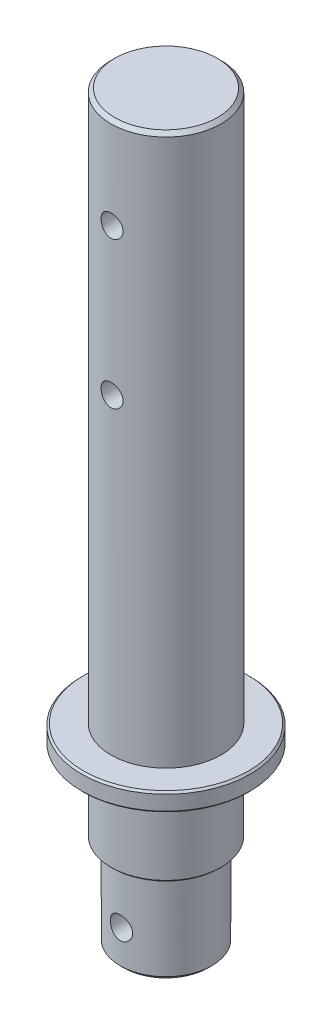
ISO-10303-21;
HEADER;
FILE_DESCRIPTION(('STEP AP214'),'2;1');
FILE_NAME('part.step','',(''),(''),'','','');
FILE_SCHEMA(('AUTOMOTIVE_DESIGN { 1 0 10303 214 1 1 1 1 }'));
ENDSEC;
DATA;
#1=APPLICATION_CONTEXT('core data for automotive mechanical design processes');
#2=APPLICATION_PROTOCOL_DEFINITION('international standard','automotive_design',2000,#1);
#3=PRODUCT_CONTEXT('',#1,'mechanical');
#4=PRODUCT('Part','Part','',(#3));
#5=PRODUCT_RELATED_PRODUCT_CATEGORY('part','',(#4));
#6=PRODUCT_DEFINITION_FORMATION('','',#4);
#7=PRODUCT_DEFINITION_CONTEXT('part definition',#1,'design');
#8=PRODUCT_DEFINITION('design','',#6,#7);
#9=PRODUCT_DEFINITION_SHAPE('','',#8);
#10=(LENGTH_UNIT() NAMED_UNIT(*) SI_UNIT(.MILLI.,.METRE.));
#11=(NAMED_UNIT(*) PLANE_ANGLE_UNIT() SI_UNIT($,.RADIAN.));
#12=(NAMED_UNIT(*) SI_UNIT($,.STERADIAN.) SOLID_ANGLE_UNIT());
#13=UNCERTAINTY_MEASURE_WITH_UNIT(LENGTH_MEASURE(1.E-05),#10,'distance_accuracy_value','');
#14=(GEOMETRIC_REPRESENTATION_CONTEXT(3) GLOBAL_UNCERTAINTY_ASSIGNED_CONTEXT((#13)) GLOBAL_UNIT_ASSIGNED_CONTEXT((#10,
#11,#12)) REPRESENTATION_CONTEXT('',''));
#15=CARTESIAN_POINT('',(0.,0.,0.));
#16=DIRECTION('',(0.,0.,1.));
#17=DIRECTION('',(1.,0.,0.));
#18=AXIS2_PLACEMENT_3D('',#15,#16,#17);
#19=CARTESIAN_POINT('',(-15.,202.,0.));
#20=DIRECTION('',(0.,1.,0.));
#21=DIRECTION('',(0.,0.,1.));
#22=AXIS2_PLACEMENT_3D('',#19,#20,#21);
#23=PLANE('',#22);
#24=CARTESIAN_POINT('',(0.,202.,0.));
#25=DIRECTION('',(0.,1.,0.));
#26=DIRECTION('',(0.,0.,1.));
#27=AXIS2_PLACEMENT_3D('',#24,#25,#26);
#28=CIRCLE('',#27,14.);
#29=CARTESIAN_POINT('',(0.,202.,14.));
#30=VERTEX_POINT('',#29);
#31=EDGE_CURVE('E149',#30,#30,#28,.T.);
#32=ORIENTED_EDGE('',*,*,#31,.T.);
#33=EDGE_LOOP('',(#32));
#34=FACE_BOUND('',#33,.T.);
#35=ADVANCED_FACE('F33',(#34),#23,.T.);
#36=CARTESIAN_POINT('',(0.,215.720868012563,0.));
#37=DIRECTION('',(0.,1.,0.));
#38=DIRECTION('',(0.,0.,1.));
#39=AXIS2_PLACEMENT_3D('',#36,#37,#38);
#40=CYLINDRICAL_SURFACE('',#39,15.);
#41=CARTESIAN_POINT('',(0.,134.,15.));
#42=CARTESIAN_POINT('',(0.1667307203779,134.000006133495,14.9999969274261));
#43=CARTESIAN_POINT('',(0.333538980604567,134.013946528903,14.9971915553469));
#44=CARTESIAN_POINT('',(0.662440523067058,134.069295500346,14.9862709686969));
#45=CARTESIAN_POINT('',(0.824529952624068,134.110725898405,14.9781515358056));
#46=CARTESIAN_POINT('',(1.13919091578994,134.219723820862,14.9575094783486));
#47=CARTESIAN_POINT('',(1.2917714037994,134.287266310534,14.9449910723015));
#48=CARTESIAN_POINT('',(1.58342396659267,134.446496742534,14.9169119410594));
#49=CARTESIAN_POINT('',(1.72249684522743,134.538183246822,14.9013513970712));
#50=CARTESIAN_POINT('',(1.9850804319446,134.744415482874,14.8686649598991));
#51=CARTESIAN_POINT('',(2.10838185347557,134.859225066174,14.8515223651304));
#52=CARTESIAN_POINT('',(2.33411026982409,135.107877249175,14.8177254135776));
#53=CARTESIAN_POINT('',(2.43653563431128,135.241721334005,14.8010710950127));
#54=CARTESIAN_POINT('',(2.61849526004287,135.526148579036,14.7699732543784));
#55=CARTESIAN_POINT('',(2.6978128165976,135.676872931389,14.7555512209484));
#56=CARTESIAN_POINT('',(2.82991699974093,135.989845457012,14.7307880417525));
#57=CARTESIAN_POINT('',(2.88270624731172,136.152092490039,14.7204464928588));
#58=CARTESIAN_POINT('',(2.95957589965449,136.481253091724,14.7051841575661));
#59=CARTESIAN_POINT('',(2.98402349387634,136.648077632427,14.7001941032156));
#60=CARTESIAN_POINT('',(3.00465638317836,136.983529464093,14.6959912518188));
#61=CARTESIAN_POINT('',(3.0008445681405,137.15215656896,14.6967778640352));
#62=CARTESIAN_POINT('',(2.96536371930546,137.483740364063,14.7039765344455));
#63=CARTESIAN_POINT('',(2.93411562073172,137.646744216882,14.7103035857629));
#64=CARTESIAN_POINT('',(2.84531365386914,137.965148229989,14.7277363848));
#65=CARTESIAN_POINT('',(2.78775852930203,138.120548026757,14.7388423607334));
#66=CARTESIAN_POINT('',(2.64757435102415,138.420545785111,14.7646685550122));
#67=CARTESIAN_POINT('',(2.56477845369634,138.565063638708,14.7794126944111));
#68=CARTESIAN_POINT('',(2.37658072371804,138.838312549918,14.8108385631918));
#69=CARTESIAN_POINT('',(2.27117629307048,138.967041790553,14.827520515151));
#70=CARTESIAN_POINT('',(2.03849980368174,139.207488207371,14.8613106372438));
#71=CARTESIAN_POINT('',(1.91086848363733,139.318857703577,14.8784210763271));
#72=CARTESIAN_POINT('',(1.63855507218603,139.518661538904,14.9108654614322));
#73=CARTESIAN_POINT('',(1.49387276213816,139.607095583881,14.9261993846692));
#74=CARTESIAN_POINT('',(1.19117816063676,139.758582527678,14.9534007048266));
#75=CARTESIAN_POINT('',(1.03314545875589,139.821595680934,14.9652626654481));
#76=CARTESIAN_POINT('',(0.708446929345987,139.920081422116,14.9841422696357));
#77=CARTESIAN_POINT('',(0.541782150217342,139.955557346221,14.9911605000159));
#78=CARTESIAN_POINT('',(0.207538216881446,139.997469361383,14.999480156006));
#79=CARTESIAN_POINT('',(0.0400209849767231,140.004381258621,15.0008752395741));
#80=CARTESIAN_POINT('',(-0.293774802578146,139.990250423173,14.9980515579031));
#81=CARTESIAN_POINT('',(-0.460053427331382,139.969209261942,14.9938331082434));
#82=CARTESIAN_POINT('',(-0.785116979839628,139.900164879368,14.9803149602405));
#83=CARTESIAN_POINT('',(-0.943955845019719,139.852405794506,14.9710612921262));
#84=CARTESIAN_POINT('',(-1.25137088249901,139.731548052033,14.948506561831));
#85=CARTESIAN_POINT('',(-1.39994628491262,139.65844749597,14.9352051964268));
#86=CARTESIAN_POINT('',(-1.68462352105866,139.487952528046,14.9057973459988));
#87=CARTESIAN_POINT('',(-1.82055038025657,139.390271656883,14.8896585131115));
#88=CARTESIAN_POINT('',(-2.07425405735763,139.173772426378,14.8564420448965));
#89=CARTESIAN_POINT('',(-2.19202892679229,139.0549518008,14.8393643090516));
#90=CARTESIAN_POINT('',(-2.40792177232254,138.797379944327,14.8058791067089));
#91=CARTESIAN_POINT('',(-2.50571310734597,138.658352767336,14.7894858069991));
#92=CARTESIAN_POINT('',(-2.67655626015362,138.36556591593,14.7595257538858));
#93=CARTESIAN_POINT('',(-2.74960906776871,138.211806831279,14.7459588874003));
#94=CARTESIAN_POINT('',(-2.86845552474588,137.894695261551,14.7233022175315));
#95=CARTESIAN_POINT('',(-2.91439049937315,137.731397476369,14.7141892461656));
#96=CARTESIAN_POINT('',(-2.97812595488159,137.399199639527,14.7014231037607));
#97=CARTESIAN_POINT('',(-2.99593010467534,137.230300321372,14.6977692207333));
#98=CARTESIAN_POINT('',(-3.00276273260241,136.894973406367,14.6963744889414));
#99=CARTESIAN_POINT('',(-2.99230736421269,136.728556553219,14.698527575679));
#100=CARTESIAN_POINT('',(-2.94405691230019,136.399905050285,14.7082672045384));
#101=CARTESIAN_POINT('',(-2.9062620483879,136.237670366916,14.7158537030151));
#102=CARTESIAN_POINT('',(-2.80463570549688,135.922316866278,14.7355579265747));
#103=CARTESIAN_POINT('',(-2.74086752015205,135.769176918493,14.7476646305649));
#104=CARTESIAN_POINT('',(-2.58916393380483,135.475688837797,14.7750514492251));
#105=CARTESIAN_POINT('',(-2.50122650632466,135.335341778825,14.7903318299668));
#106=CARTESIAN_POINT('',(-2.30191774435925,135.068853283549,14.8226688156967));
#107=CARTESIAN_POINT('',(-2.19017366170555,134.942993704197,14.839751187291));
#108=CARTESIAN_POINT('',(-1.94719310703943,134.711641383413,14.8735824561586));
#109=CARTESIAN_POINT('',(-1.81595216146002,134.606153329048,14.8903312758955));
#110=CARTESIAN_POINT('',(-1.53605288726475,134.417496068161,14.9218149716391));
#111=CARTESIAN_POINT('',(-1.38722665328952,134.33457199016,14.9365269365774));
#112=CARTESIAN_POINT('',(-1.0774990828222,134.19504163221,14.96205375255));
#113=CARTESIAN_POINT('',(-0.916608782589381,134.138411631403,14.9728721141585));
#114=CARTESIAN_POINT('',(-0.629464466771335,134.064044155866,14.9872911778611));
#115=CARTESIAN_POINT('',(-0.50484499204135,134.040070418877,14.9920290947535));
#116=CARTESIAN_POINT('',(-0.253498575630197,134.008046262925,14.9983846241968));
#117=CARTESIAN_POINT('',(-0.126771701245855,133.999995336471,15.0000023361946));
#118=CARTESIAN_POINT('',(0.,134.,15.));
#119=B_SPLINE_CURVE_WITH_KNOTS('',3,(#41,#42,#43,#44,#45,#46,#47,#48,#49,#50,#51,#52,#53,#54,
#55,#56,#57,#58,#59,#60,#61,#62,#63,#64,#65,#66,#67,#68,#69,#70,#71,#72,#73,#74,#75,#76,#77,#78,
#79,#80,#81,#82,#83,#84,#85,#86,#87,#88,#89,#90,#91,#92,#93,#94,#95,#96,#97,#98,#99,#100,#101,
#102,#103,#104,#105,#106,#107,#108,#109,#110,#111,#112,#113,#114,#115,#116,#117,#118),
.UNSPECIFIED.,.T.,.F.,(4,2,2,2,2,2,2,2,2,2,2,2,2,2,2,2,2,2,2,2,2,2,2,2,2,2,2,2,2,2,2,2,2,2,2,2,
2,2,4),(0.,0.499728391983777,0.999853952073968,1.49950120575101,1.99911870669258,
2.50479801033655,3.01051679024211,3.52083585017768,4.03110448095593,4.53468555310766,
5.03821512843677,5.53415181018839,6.03011217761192,6.52942470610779,7.02879464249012,
7.53714757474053,8.04550702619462,8.55465824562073,9.06374777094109,9.56432207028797,
10.064868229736,10.5609136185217,11.0569961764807,11.5591519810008,12.0613616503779,
12.5712188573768,13.081055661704,13.5882114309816,14.0953010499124,14.593191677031,
15.0910783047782,15.5877588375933,16.084481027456,16.5896422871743,17.0949196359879,
17.6054849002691,18.1155886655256,18.4955632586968,18.8755257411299),.UNSPECIFIED.);
#120=CARTESIAN_POINT('',(0.,134.,15.));
#121=VERTEX_POINT('',#120);
#122=EDGE_CURVE('E96',#121,#121,#119,.T.);
#123=ORIENTED_EDGE('',*,*,#122,.F.);
#124=EDGE_LOOP('',(#123));
#125=FACE_BOUND('',#124,.T.);
#126=CARTESIAN_POINT('',(3.,137.,-14.6969384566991));
#127=CARTESIAN_POINT('',(2.99999383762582,136.833306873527,-14.6969417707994));
#128=CARTESIAN_POINT('',(2.98605951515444,136.66653613,-14.699805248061));
#129=CARTESIAN_POINT('',(2.93073685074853,136.337712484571,-14.7109329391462));
#130=CARTESIAN_POINT('',(2.88932654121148,136.175663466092,-14.7192014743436));
#131=CARTESIAN_POINT('',(2.78038734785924,135.861088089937,-14.7401662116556));
#132=CARTESIAN_POINT('',(2.71288444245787,135.708552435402,-14.7528580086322));
#133=CARTESIAN_POINT('',(2.55374732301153,135.416975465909,-14.7812339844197));
#134=CARTESIAN_POINT('',(2.46211445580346,135.277933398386,-14.7969179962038));
#135=CARTESIAN_POINT('',(2.25593722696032,135.015316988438,-14.8297589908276));
#136=CARTESIAN_POINT('',(2.14111696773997,134.891961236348,-14.8469321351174));
#137=CARTESIAN_POINT('',(1.89242036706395,134.666127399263,-14.8806741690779));
#138=CARTESIAN_POINT('',(1.75854269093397,134.563650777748,-14.8972430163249));
#139=CARTESIAN_POINT('',(1.47408406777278,134.381635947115,-14.9280838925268));
#140=CARTESIAN_POINT('',(1.32336770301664,134.30230545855,-14.9423346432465));
#141=CARTESIAN_POINT('',(1.01041245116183,134.170175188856,-14.9667521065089));
#142=CARTESIAN_POINT('',(0.848174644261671,134.117372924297,-14.9769192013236));
#143=CARTESIAN_POINT('',(0.519050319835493,134.040478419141,-14.9919096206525));
#144=CARTESIAN_POINT('',(0.352253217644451,134.016017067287,-14.9968015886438));
#145=CARTESIAN_POINT('',(0.0168557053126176,133.995347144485,-15.0009276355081));
#146=CARTESIAN_POINT('',(-0.15174452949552,133.999135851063,-15.0001622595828));
#147=CARTESIAN_POINT('',(-0.483426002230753,134.034578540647,-14.9931130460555));
#148=CARTESIAN_POINT('',(-0.646551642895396,134.065834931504,-14.9869079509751));
#149=CARTESIAN_POINT('',(-0.965194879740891,134.154695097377,-14.9697653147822));
#150=CARTESIAN_POINT('',(-1.12071217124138,134.212299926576,-14.9588275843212));
#151=CARTESIAN_POINT('',(-1.42085838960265,134.352590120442,-14.9333188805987));
#152=CARTESIAN_POINT('',(-1.56541252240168,134.435431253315,-14.9187254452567));
#153=CARTESIAN_POINT('',(-1.83871513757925,134.62372723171,-14.8875140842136));
#154=CARTESIAN_POINT('',(-1.967461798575,134.729184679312,-14.8708959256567));
#155=CARTESIAN_POINT('',(-2.20785429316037,134.961900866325,-14.8371289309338));
#156=CARTESIAN_POINT('',(-2.31916294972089,135.089507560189,-14.8199758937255));
#157=CARTESIAN_POINT('',(-2.51885547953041,135.361749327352,-14.7873471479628));
#158=CARTESIAN_POINT('',(-2.60723891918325,135.50638472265,-14.7718714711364));
#159=CARTESIAN_POINT('',(-2.75868844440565,135.809062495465,-14.7443414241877));
#160=CARTESIAN_POINT('',(-2.82169994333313,135.967132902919,-14.7322944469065));
#161=CARTESIAN_POINT('',(-2.92017102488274,136.291913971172,-14.7130942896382));
#162=CARTESIAN_POINT('',(-2.95563419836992,136.458623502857,-14.7059404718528));
#163=CARTESIAN_POINT('',(-2.99749801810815,136.792894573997,-14.6974643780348));
#164=CARTESIAN_POINT('',(-3.00438557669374,136.960392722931,-14.6960444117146));
#165=CARTESIAN_POINT('',(-2.99021288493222,137.294144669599,-14.6989345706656));
#166=CARTESIAN_POINT('',(-2.96915421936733,137.460398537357,-14.7032443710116));
#167=CARTESIAN_POINT('',(-2.90010662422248,137.785305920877,-14.7170169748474));
#168=CARTESIAN_POINT('',(-2.8523778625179,137.944017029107,-14.7264299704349));
#169=CARTESIAN_POINT('',(-2.73162310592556,138.251189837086,-14.7493046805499));
#170=CARTESIAN_POINT('',(-2.65859502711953,138.399650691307,-14.7627667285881));
#171=CARTESIAN_POINT('',(-2.4882124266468,138.68423932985,-14.7924421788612));
#172=CARTESIAN_POINT('',(-2.39055323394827,138.820181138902,-14.8086891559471));
#173=CARTESIAN_POINT('',(-2.17408671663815,139.073924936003,-14.8420117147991));
#174=CARTESIAN_POINT('',(-2.05527721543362,139.191725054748,-14.8590873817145));
#175=CARTESIAN_POINT('',(-1.79769682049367,139.407687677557,-14.8924603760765));
#176=CARTESIAN_POINT('',(-1.65864749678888,139.50552096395,-14.9087417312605));
#177=CARTESIAN_POINT('',(-1.36580368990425,139.676437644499,-14.9384138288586));
#178=CARTESIAN_POINT('',(-1.21200982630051,139.749522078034,-14.9518046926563));
#179=CARTESIAN_POINT('',(-0.894908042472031,139.86838661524,-14.974118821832));
#180=CARTESIAN_POINT('',(-0.731660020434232,139.914321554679,-14.9830673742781));
#181=CARTESIAN_POINT('',(-0.399568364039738,139.978073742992,-14.9955970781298));
#182=CARTESIAN_POINT('',(-0.230725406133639,139.995894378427,-14.9991788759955));
#183=CARTESIAN_POINT('',(0.10461868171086,140.002780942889,-15.0005562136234));
#184=CARTESIAN_POINT('',(0.27110943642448,139.992341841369,-14.9984513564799));
#185=CARTESIAN_POINT('',(0.599913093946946,139.944098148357,-14.9889013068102));
#186=CARTESIAN_POINT('',(0.76222604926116,139.906293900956,-14.9814561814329));
#187=CARTESIAN_POINT('',(1.07775824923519,139.804613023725,-14.9620649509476));
#188=CARTESIAN_POINT('',(1.23099732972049,139.740795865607,-14.9501291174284));
#189=CARTESIAN_POINT('',(1.5246636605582,139.588963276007,-14.9230416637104));
#190=CARTESIAN_POINT('',(1.66508989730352,139.500945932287,-14.9078897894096));
#191=CARTESIAN_POINT('',(1.93159167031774,139.301541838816,-14.8757279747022));
#192=CARTESIAN_POINT('',(2.05739914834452,139.189800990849,-14.858692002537));
#193=CARTESIAN_POINT('',(2.28864785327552,138.946849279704,-14.8248366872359));
#194=CARTESIAN_POINT('',(2.39408424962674,138.81563381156,-14.8080173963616));
#195=CARTESIAN_POINT('',(2.58267665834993,138.535762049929,-14.7763002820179));
#196=CARTESIAN_POINT('',(2.66558044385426,138.386933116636,-14.7614251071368));
#197=CARTESIAN_POINT('',(2.80507214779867,138.07720168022,-14.7355571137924));
#198=CARTESIAN_POINT('',(2.86168393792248,137.916310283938,-14.7245607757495));
#199=CARTESIAN_POINT('',(2.93600741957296,137.629212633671,-14.7098904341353));
#200=CARTESIAN_POINT('',(2.95996169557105,137.504643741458,-14.7050635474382));
#201=CARTESIAN_POINT('',(2.99196005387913,137.253398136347,-14.6985863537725));
#202=CARTESIAN_POINT('',(3.00000468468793,137.126721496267,-14.6969359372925));
#203=CARTESIAN_POINT('',(3.,137.,-14.6969384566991));
#204=B_SPLINE_CURVE_WITH_KNOTS('',3,(#126,#127,#128,#129,#130,#131,#132,#133,#134,#135,#136,
#137,#138,#139,#140,#141,#142,#143,#144,#145,#146,#147,#148,#149,#150,#151,#152,#153,#154,#155,
#156,#157,#158,#159,#160,#161,#162,#163,#164,#165,#166,#167,#168,#169,#170,#171,#172,#173,#174,
#175,#176,#177,#178,#179,#180,#181,#182,#183,#184,#185,#186,#187,#188,#189,#190,#191,#192,#193,
#194,#195,#196,#197,#198,#199,#200,#201,#202,#203),.UNSPECIFIED.,.T.,.F.,(4,2,2,2,2,2,2,2,2,2,2,
2,2,2,2,2,2,2,2,2,2,2,2,2,2,2,2,2,2,2,2,2,2,2,2,2,2,2,4),(0.,0.499615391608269,
0.999630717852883,1.49914949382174,1.99864039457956,2.50446757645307,3.01033020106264,
3.52060201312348,4.03082604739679,4.5343274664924,5.03778036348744,5.53406368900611,
6.0303668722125,6.52979772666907,7.02928607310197,7.5374804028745,8.04568434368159,
8.5549758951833,9.06420105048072,9.5647127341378,10.0651960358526,10.5608802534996,
11.056605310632,11.5587917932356,12.0610299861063,12.5709780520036,13.0809046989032,
13.5878944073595,14.0948230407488,14.5929305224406,15.0910317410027,15.5880005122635,
16.0850085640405,16.5900345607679,17.0951801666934,17.6057669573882,18.1158892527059,
18.4957141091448,18.8755258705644),.UNSPECIFIED.);
#205=CARTESIAN_POINT('',(3.,137.,-14.6969384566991));
#206=VERTEX_POINT('',#205);
#207=EDGE_CURVE('E67',#206,#206,#204,.T.);
#208=ORIENTED_EDGE('',*,*,#207,.F.);
#209=EDGE_LOOP('',(#208));
#210=FACE_BOUND('',#209,.T.);
#211=CARTESIAN_POINT('',(0.,174.,15.));
#212=CARTESIAN_POINT('',(0.1667307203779,174.000006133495,14.9999969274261));
#213=CARTESIAN_POINT('',(0.333538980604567,174.013946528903,14.9971915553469));
#214=CARTESIAN_POINT('',(0.662440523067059,174.069295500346,14.9862709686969));
#215=CARTESIAN_POINT('',(0.824529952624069,174.110725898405,14.9781515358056));
#216=CARTESIAN_POINT('',(1.13919091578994,174.219723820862,14.9575094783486));
#217=CARTESIAN_POINT('',(1.2917714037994,174.287266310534,14.9449910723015));
#218=CARTESIAN_POINT('',(1.58342396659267,174.446496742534,14.9169119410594));
#219=CARTESIAN_POINT('',(1.72249684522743,174.538183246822,14.9013513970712));
#220=CARTESIAN_POINT('',(1.9850804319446,174.744415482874,14.8686649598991));
#221=CARTESIAN_POINT('',(2.10838185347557,174.859225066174,14.8515223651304));
#222=CARTESIAN_POINT('',(2.33411026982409,175.107877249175,14.8177254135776));
#223=CARTESIAN_POINT('',(2.43653563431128,175.241721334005,14.8010710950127));
#224=CARTESIAN_POINT('',(2.61849526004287,175.526148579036,14.7699732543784));
#225=CARTESIAN_POINT('',(2.69781281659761,175.676872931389,14.7555512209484));
#226=CARTESIAN_POINT('',(2.82991699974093,175.989845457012,14.7307880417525));
#227=CARTESIAN_POINT('',(2.88270624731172,176.152092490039,14.7204464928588));
#228=CARTESIAN_POINT('',(2.95957589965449,176.481253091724,14.7051841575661));
#229=CARTESIAN_POINT('',(2.98402349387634,176.648077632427,14.7001941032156));
#230=CARTESIAN_POINT('',(3.00465638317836,176.983529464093,14.6959912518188));
#231=CARTESIAN_POINT('',(3.0008445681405,177.15215656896,14.6967778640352));
#232=CARTESIAN_POINT('',(2.96536371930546,177.483740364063,14.7039765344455));
#233=CARTESIAN_POINT('',(2.93411562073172,177.646744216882,14.7103035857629));
#234=CARTESIAN_POINT('',(2.84531365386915,177.965148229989,14.7277363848));
#235=CARTESIAN_POINT('',(2.78775852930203,178.120548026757,14.7388423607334));
#236=CARTESIAN_POINT('',(2.64757435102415,178.420545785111,14.7646685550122));
#237=CARTESIAN_POINT('',(2.56477845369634,178.565063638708,14.7794126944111));
#238=CARTESIAN_POINT('',(2.37658072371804,178.838312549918,14.8108385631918));
#239=CARTESIAN_POINT('',(2.27117629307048,178.967041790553,14.827520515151));
#240=CARTESIAN_POINT('',(2.03849980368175,179.207488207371,14.8613106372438));
#241=CARTESIAN_POINT('',(1.91086848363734,179.318857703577,14.8784210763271));
#242=CARTESIAN_POINT('',(1.63855507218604,179.518661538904,14.9108654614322));
#243=CARTESIAN_POINT('',(1.49387276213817,179.607095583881,14.9261993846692));
#244=CARTESIAN_POINT('',(1.19117816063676,179.758582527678,14.9534007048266));
#245=CARTESIAN_POINT('',(1.0331454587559,179.821595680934,14.9652626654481));
#246=CARTESIAN_POINT('',(0.708446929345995,179.920081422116,14.9841422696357));
#247=CARTESIAN_POINT('',(0.541782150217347,179.955557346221,14.9911605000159));
#248=CARTESIAN_POINT('',(0.207538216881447,179.997469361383,14.999480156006));
#249=CARTESIAN_POINT('',(0.0400209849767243,180.004381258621,15.0008752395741));
#250=CARTESIAN_POINT('',(-0.293774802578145,179.990250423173,14.9980515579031));
#251=CARTESIAN_POINT('',(-0.460053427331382,179.969209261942,14.9938331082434));
#252=CARTESIAN_POINT('',(-0.785116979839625,179.900164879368,14.9803149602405));
#253=CARTESIAN_POINT('',(-0.943955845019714,179.852405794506,14.9710612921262));
#254=CARTESIAN_POINT('',(-1.25137088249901,179.731548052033,14.948506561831));
#255=CARTESIAN_POINT('',(-1.39994628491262,179.65844749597,14.9352051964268));
#256=CARTESIAN_POINT('',(-1.68462352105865,179.487952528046,14.9057973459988));
#257=CARTESIAN_POINT('',(-1.82055038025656,179.390271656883,14.8896585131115));
#258=CARTESIAN_POINT('',(-2.07425405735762,179.173772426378,14.8564420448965));
#259=CARTESIAN_POINT('',(-2.19202892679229,179.0549518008,14.8393643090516));
#260=CARTESIAN_POINT('',(-2.40792177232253,178.797379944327,14.8058791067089));
#261=CARTESIAN_POINT('',(-2.50571310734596,178.658352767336,14.7894858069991));
#262=CARTESIAN_POINT('',(-2.67655626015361,178.36556591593,14.7595257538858));
#263=CARTESIAN_POINT('',(-2.74960906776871,178.211806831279,14.7459588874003));
#264=CARTESIAN_POINT('',(-2.86845552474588,177.894695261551,14.7233022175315));
#265=CARTESIAN_POINT('',(-2.91439049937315,177.731397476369,14.7141892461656));
#266=CARTESIAN_POINT('',(-2.97812595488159,177.399199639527,14.7014231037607));
#267=CARTESIAN_POINT('',(-2.99593010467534,177.230300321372,14.6977692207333));
#268=CARTESIAN_POINT('',(-3.00276273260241,176.894973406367,14.6963744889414));
#269=CARTESIAN_POINT('',(-2.99230736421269,176.728556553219,14.698527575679));
#270=CARTESIAN_POINT('',(-2.94405691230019,176.399905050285,14.7082672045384));
#271=CARTESIAN_POINT('',(-2.9062620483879,176.237670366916,14.7158537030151));
#272=CARTESIAN_POINT('',(-2.80463570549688,175.922316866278,14.7355579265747));
#273=CARTESIAN_POINT('',(-2.74086752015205,175.769176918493,14.7476646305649));
#274=CARTESIAN_POINT('',(-2.58916393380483,175.475688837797,14.7750514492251));
#275=CARTESIAN_POINT('',(-2.50122650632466,175.335341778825,14.7903318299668));
#276=CARTESIAN_POINT('',(-2.30191774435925,175.068853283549,14.8226688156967));
#277=CARTESIAN_POINT('',(-2.19017366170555,174.942993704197,14.839751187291));
#278=CARTESIAN_POINT('',(-1.94719310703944,174.711641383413,14.8735824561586));
#279=CARTESIAN_POINT('',(-1.81595216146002,174.606153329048,14.8903312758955));
#280=CARTESIAN_POINT('',(-1.53605288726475,174.417496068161,14.9218149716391));
#281=CARTESIAN_POINT('',(-1.38722665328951,174.33457199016,14.9365269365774));
#282=CARTESIAN_POINT('',(-1.0774990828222,174.19504163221,14.96205375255));
#283=CARTESIAN_POINT('',(-0.916608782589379,174.138411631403,14.9728721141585));
#284=CARTESIAN_POINT('',(-0.629464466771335,174.064044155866,14.9872911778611));
#285=CARTESIAN_POINT('',(-0.50484499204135,174.040070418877,14.9920290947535));
#286=CARTESIAN_POINT('',(-0.253498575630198,174.008046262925,14.9983846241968));
#287=CARTESIAN_POINT('',(-0.126771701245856,173.999995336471,15.0000023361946));
#288=CARTESIAN_POINT('',(0.,174.,15.));
#289=B_SPLINE_CURVE_WITH_KNOTS('',3,(#211,#212,#213,#214,#215,#216,#217,#218,#219,#220,#221,
#222,#223,#224,#225,#226,#227,#228,#229,#230,#231,#232,#233,#234,#235,#236,#237,#238,#239,#240,
#241,#242,#243,#244,#245,#246,#247,#248,#249,#250,#251,#252,#253,#254,#255,#256,#257,#258,#259,
#260,#261,#262,#263,#264,#265,#266,#267,#268,#269,#270,#271,#272,#273,#274,#275,#276,#277,#278,
#279,#280,#281,#282,#283,#284,#285,#286,#287,#288),.UNSPECIFIED.,.T.,.F.,(4,2,2,2,2,2,2,2,2,2,2,
2,2,2,2,2,2,2,2,2,2,2,2,2,2,2,2,2,2,2,2,2,2,2,2,2,2,2,4),(0.,0.499728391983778,
0.999853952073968,1.49950120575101,1.99911870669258,2.50479801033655,3.01051679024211,
3.52083585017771,4.03110448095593,4.53468555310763,5.03821512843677,5.53415181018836,
6.03011217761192,6.52942470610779,7.02879464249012,7.53714757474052,8.04550702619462,
8.55465824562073,9.0637477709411,9.56432207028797,10.064868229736,10.5609136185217,
11.0569961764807,11.5591519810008,12.0613616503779,12.5712188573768,13.081055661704,
13.5882114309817,14.0953010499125,14.593191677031,15.0910783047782,15.5877588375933,
16.084481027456,16.5896422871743,17.0949196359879,17.6054849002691,18.1155886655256,
18.4955632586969,18.8755257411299),.UNSPECIFIED.);
#290=CARTESIAN_POINT('',(0.,174.,15.));
#291=VERTEX_POINT('',#290);
#292=EDGE_CURVE('E117',#291,#291,#289,.T.);
#293=ORIENTED_EDGE('',*,*,#292,.F.);
#294=EDGE_LOOP('',(#293));
#295=FACE_BOUND('',#294,.T.);
#296=CARTESIAN_POINT('',(3.,177.,-14.6969384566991));
#297=CARTESIAN_POINT('',(2.99999383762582,176.833306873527,-14.6969417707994));
#298=CARTESIAN_POINT('',(2.98605951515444,176.66653613,-14.699805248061));
#299=CARTESIAN_POINT('',(2.93073685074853,176.337712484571,-14.7109329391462));
#300=CARTESIAN_POINT('',(2.88932654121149,176.175663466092,-14.7192014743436));
#301=CARTESIAN_POINT('',(2.78038734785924,175.861088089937,-14.7401662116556));
#302=CARTESIAN_POINT('',(2.71288444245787,175.708552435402,-14.7528580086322));
#303=CARTESIAN_POINT('',(2.55374732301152,175.416975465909,-14.7812339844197));
#304=CARTESIAN_POINT('',(2.46211445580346,175.277933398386,-14.7969179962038));
#305=CARTESIAN_POINT('',(2.25593722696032,175.015316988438,-14.8297589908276));
#306=CARTESIAN_POINT('',(2.14111696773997,174.891961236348,-14.8469321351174));
#307=CARTESIAN_POINT('',(1.89242036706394,174.666127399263,-14.8806741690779));
#308=CARTESIAN_POINT('',(1.75854269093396,174.563650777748,-14.8972430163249));
#309=CARTESIAN_POINT('',(1.47408406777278,174.381635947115,-14.9280838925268));
#310=CARTESIAN_POINT('',(1.32336770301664,174.30230545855,-14.9423346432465));
#311=CARTESIAN_POINT('',(1.01041245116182,174.170175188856,-14.9667521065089));
#312=CARTESIAN_POINT('',(0.848174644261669,174.117372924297,-14.9769192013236));
#313=CARTESIAN_POINT('',(0.519050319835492,174.040478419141,-14.9919096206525));
#314=CARTESIAN_POINT('',(0.352253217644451,174.016017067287,-14.9968015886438));
#315=CARTESIAN_POINT('',(0.0168557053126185,173.995347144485,-15.0009276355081));
#316=CARTESIAN_POINT('',(-0.151744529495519,173.999135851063,-15.0001622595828));
#317=CARTESIAN_POINT('',(-0.483426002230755,174.034578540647,-14.9931130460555));
#318=CARTESIAN_POINT('',(-0.6465516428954,174.065834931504,-14.9869079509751));
#319=CARTESIAN_POINT('',(-0.965194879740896,174.154695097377,-14.9697653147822));
#320=CARTESIAN_POINT('',(-1.12071217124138,174.212299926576,-14.9588275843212));
#321=CARTESIAN_POINT('',(-1.42085838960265,174.352590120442,-14.9333188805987));
#322=CARTESIAN_POINT('',(-1.56541252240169,174.435431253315,-14.9187254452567));
#323=CARTESIAN_POINT('',(-1.83871513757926,174.62372723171,-14.8875140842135));
#324=CARTESIAN_POINT('',(-1.967461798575,174.729184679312,-14.8708959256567));
#325=CARTESIAN_POINT('',(-2.20785429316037,174.961900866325,-14.8371289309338));
#326=CARTESIAN_POINT('',(-2.31916294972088,175.089507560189,-14.8199758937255));
#327=CARTESIAN_POINT('',(-2.51885547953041,175.361749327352,-14.7873471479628));
#328=CARTESIAN_POINT('',(-2.60723891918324,175.50638472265,-14.7718714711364));
#329=CARTESIAN_POINT('',(-2.75868844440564,175.809062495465,-14.7443414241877));
#330=CARTESIAN_POINT('',(-2.82169994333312,175.967132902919,-14.7322944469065));
#331=CARTESIAN_POINT('',(-2.92017102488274,176.291913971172,-14.7130942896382));
#332=CARTESIAN_POINT('',(-2.95563419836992,176.458623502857,-14.7059404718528));
#333=CARTESIAN_POINT('',(-2.99749801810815,176.792894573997,-14.6974643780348));
#334=CARTESIAN_POINT('',(-3.00438557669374,176.960392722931,-14.6960444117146));
#335=CARTESIAN_POINT('',(-2.99021288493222,177.294144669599,-14.6989345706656));
#336=CARTESIAN_POINT('',(-2.96915421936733,177.460398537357,-14.7032443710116));
#337=CARTESIAN_POINT('',(-2.90010662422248,177.785305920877,-14.7170169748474));
#338=CARTESIAN_POINT('',(-2.85237786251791,177.944017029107,-14.7264299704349));
#339=CARTESIAN_POINT('',(-2.73162310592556,178.251189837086,-14.7493046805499));
#340=CARTESIAN_POINT('',(-2.65859502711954,178.399650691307,-14.7627667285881));
#341=CARTESIAN_POINT('',(-2.4882124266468,178.68423932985,-14.7924421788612));
#342=CARTESIAN_POINT('',(-2.39055323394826,178.820181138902,-14.8086891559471));
#343=CARTESIAN_POINT('',(-2.17408671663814,179.073924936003,-14.8420117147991));
#344=CARTESIAN_POINT('',(-2.05527721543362,179.191725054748,-14.8590873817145));
#345=CARTESIAN_POINT('',(-1.79769682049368,179.407687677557,-14.8924603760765));
#346=CARTESIAN_POINT('',(-1.65864749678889,179.50552096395,-14.9087417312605));
#347=CARTESIAN_POINT('',(-1.36580368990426,179.676437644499,-14.9384138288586));
#348=CARTESIAN_POINT('',(-1.21200982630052,179.749522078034,-14.9518046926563));
#349=CARTESIAN_POINT('',(-0.894908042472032,179.86838661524,-14.974118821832));
#350=CARTESIAN_POINT('',(-0.731660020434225,179.914321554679,-14.9830673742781));
#351=CARTESIAN_POINT('',(-0.399568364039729,179.978073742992,-14.9955970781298));
#352=CARTESIAN_POINT('',(-0.230725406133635,179.995894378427,-14.9991788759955));
#353=CARTESIAN_POINT('',(0.104618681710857,180.002780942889,-15.0005562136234));
#354=CARTESIAN_POINT('',(0.271109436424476,179.992341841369,-14.9984513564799));
#355=CARTESIAN_POINT('',(0.599913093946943,179.944098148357,-14.9889013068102));
#356=CARTESIAN_POINT('',(0.762226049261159,179.906293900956,-14.9814561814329));
#357=CARTESIAN_POINT('',(1.07775824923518,179.804613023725,-14.9620649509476));
#358=CARTESIAN_POINT('',(1.23099732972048,179.740795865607,-14.9501291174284));
#359=CARTESIAN_POINT('',(1.52466366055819,179.588963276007,-14.9230416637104));
#360=CARTESIAN_POINT('',(1.66508989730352,179.500945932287,-14.9078897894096));
#361=CARTESIAN_POINT('',(1.93159167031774,179.301541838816,-14.8757279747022));
#362=CARTESIAN_POINT('',(2.05739914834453,179.189800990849,-14.858692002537));
#363=CARTESIAN_POINT('',(2.28864785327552,178.946849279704,-14.8248366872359));
#364=CARTESIAN_POINT('',(2.39408424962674,178.81563381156,-14.8080173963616));
#365=CARTESIAN_POINT('',(2.58267665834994,178.535762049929,-14.7763002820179));
#366=CARTESIAN_POINT('',(2.66558044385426,178.386933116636,-14.7614251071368));
#367=CARTESIAN_POINT('',(2.80507214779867,178.07720168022,-14.7355571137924));
#368=CARTESIAN_POINT('',(2.86168393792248,177.916310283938,-14.7245607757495));
#369=CARTESIAN_POINT('',(2.93600741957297,177.629212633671,-14.7098904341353));
#370=CARTESIAN_POINT('',(2.95996169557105,177.504643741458,-14.7050635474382));
#371=CARTESIAN_POINT('',(2.99196005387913,177.253398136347,-14.6985863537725));
#372=CARTESIAN_POINT('',(3.00000468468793,177.126721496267,-14.6969359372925));
#373=CARTESIAN_POINT('',(3.,177.,-14.6969384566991));
#374=B_SPLINE_CURVE_WITH_KNOTS('',3,(#296,#297,#298,#299,#300,#301,#302,#303,#304,#305,#306,
#307,#308,#309,#310,#311,#312,#313,#314,#315,#316,#317,#318,#319,#320,#321,#322,#323,#324,#325,
#326,#327,#328,#329,#330,#331,#332,#333,#334,#335,#336,#337,#338,#339,#340,#341,#342,#343,#344,
#345,#346,#347,#348,#349,#350,#351,#352,#353,#354,#355,#356,#357,#358,#359,#360,#361,#362,#363,
#364,#365,#366,#367,#368,#369,#370,#371,#372,#373),.UNSPECIFIED.,.T.,.F.,(4,2,2,2,2,2,2,2,2,2,2,
2,2,2,2,2,2,2,2,2,2,2,2,2,2,2,2,2,2,2,2,2,2,2,2,2,2,2,4),(0.,0.499615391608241,
0.999630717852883,1.49914949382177,1.99864039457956,2.50446757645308,3.01033020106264,
3.5206020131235,4.03082604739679,4.53432746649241,5.03778036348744,5.53406368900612,
6.0303668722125,6.5297977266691,7.02928607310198,7.53748040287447,8.04568434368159,
8.55497589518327,9.06420105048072,9.56471273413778,10.0651960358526,10.5608802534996,
11.056605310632,11.5587917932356,12.0610299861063,12.5709780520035,13.0809046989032,
13.5878944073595,14.0948230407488,14.5929305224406,15.0910317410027,15.5880005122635,
16.0850085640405,16.5900345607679,17.0951801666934,17.6057669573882,18.1158892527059,
18.4957141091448,18.8755258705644),.UNSPECIFIED.);
#375=CARTESIAN_POINT('',(3.,177.,-14.6969384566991));
#376=VERTEX_POINT('',#375);
#377=EDGE_CURVE('E100',#376,#376,#374,.T.);
#378=ORIENTED_EDGE('',*,*,#377,.F.);
#379=EDGE_LOOP('',(#378));
#380=FACE_BOUND('',#379,.T.);
#381=CARTESIAN_POINT('',(0.,201.,0.));
#382=DIRECTION('',(0.,1.,0.));
#383=DIRECTION('',(0.,0.,1.));
#384=AXIS2_PLACEMENT_3D('',#381,#382,#383);
#385=CIRCLE('',#384,15.);
#386=CARTESIAN_POINT('',(0.,201.,15.));
#387=VERTEX_POINT('',#386);
#388=EDGE_CURVE('E59',#387,#387,#385,.F.);
#389=ORIENTED_EDGE('',*,*,#388,.T.);
#390=EDGE_LOOP('',(#389));
#391=FACE_BOUND('',#390,.T.);
#392=CARTESIAN_POINT('',(0.,52.,0.));
#393=DIRECTION('',(0.,1.,0.));
#394=DIRECTION('',(0.,0.,1.));
#395=AXIS2_PLACEMENT_3D('',#392,#393,#394);
#396=CIRCLE('',#395,15.);
#397=CARTESIAN_POINT('',(0.,52.,15.));
#398=VERTEX_POINT('',#397);
#399=EDGE_CURVE('E137',#398,#398,#396,.T.);
#400=ORIENTED_EDGE('',*,*,#399,.T.);
#401=EDGE_LOOP('',(#400));
#402=FACE_BOUND('',#401,.T.);
#403=ADVANCED_FACE('F101',(#125,#210,#295,#380,#391,#402),#40,.T.);
#404=CARTESIAN_POINT('',(-15.,52.,0.));
#405=DIRECTION('',(0.,1.,0.));
#406=DIRECTION('',(0.,0.,1.));
#407=AXIS2_PLACEMENT_3D('',#404,#405,#406);
#408=PLANE('',#407);
#409=CARTESIAN_POINT('',(0.,52.,0.));
#410=DIRECTION('',(0.,1.,0.));
#411=DIRECTION('',(0.,0.,1.));
#412=AXIS2_PLACEMENT_3D('',#409,#410,#411);
#413=CIRCLE('',#412,22.5);
#414=CARTESIAN_POINT('',(0.,52.,22.5));
#415=VERTEX_POINT('',#414);
#416=EDGE_CURVE('E10',#415,#415,#413,.T.);
#417=ORIENTED_EDGE('',*,*,#416,.T.);
#418=EDGE_LOOP('',(#417));
#419=FACE_BOUND('',#418,.T.);
#420=ORIENTED_EDGE('',*,*,#399,.F.);
#421=EDGE_LOOP('',(#420));
#422=FACE_BOUND('',#421,.T.);
#423=ADVANCED_FACE('F106',(#419,#422),#408,.T.);
#424=CARTESIAN_POINT('',(0.,215.720868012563,0.));
#425=DIRECTION('',(0.,1.,0.));
#426=DIRECTION('',(0.,0.,1.));
#427=AXIS2_PLACEMENT_3D('',#424,#425,#426);
#428=CYLINDRICAL_SURFACE('',#427,23.);
#429=CARTESIAN_POINT('',(0.,47.5,0.));
#430=DIRECTION('',(0.,-1.,0.));
#431=DIRECTION('',(0.,0.,-1.));
#432=AXIS2_PLACEMENT_3D('',#429,#430,#431);
#433=CIRCLE('',#432,23.);
#434=CARTESIAN_POINT('',(0.,47.5,-23.));
#435=VERTEX_POINT('',#434);
#436=EDGE_CURVE('E44',#435,#435,#433,.F.);
#437=ORIENTED_EDGE('',*,*,#436,.T.);
#438=EDGE_LOOP('',(#437));
#439=FACE_BOUND('',#438,.T.);
#440=CARTESIAN_POINT('',(0.,51.4999999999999,0.));
#441=DIRECTION('',(0.,1.,0.));
#442=DIRECTION('',(0.,0.,1.));
#443=AXIS2_PLACEMENT_3D('',#440,#441,#442);
#444=CIRCLE('',#443,23.);
#445=CARTESIAN_POINT('',(0.,51.4999999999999,23.));
#446=VERTEX_POINT('',#445);
#447=EDGE_CURVE('E48',#446,#446,#444,.F.);
#448=ORIENTED_EDGE('',*,*,#447,.T.);
#449=EDGE_LOOP('',(#448));
#450=FACE_BOUND('',#449,.T.);
#451=ADVANCED_FACE('F181',(#439,#450),#428,.T.);
#452=CARTESIAN_POINT('',(-15.,47.,0.));
#453=DIRECTION('',(0.,-1.,0.));
#454=DIRECTION('',(0.,0.,-1.));
#455=AXIS2_PLACEMENT_3D('',#452,#453,#454);
#456=PLANE('',#455);
#457=CARTESIAN_POINT('',(0.,47.,0.));
#458=DIRECTION('',(0.,-1.,0.));
#459=DIRECTION('',(0.,0.,-1.));
#460=AXIS2_PLACEMENT_3D('',#457,#458,#459);
#461=CIRCLE('',#460,22.5);
#462=CARTESIAN_POINT('',(0.,47.,-22.5));
#463=VERTEX_POINT('',#462);
#464=EDGE_CURVE('E40',#463,#463,#461,.T.);
#465=ORIENTED_EDGE('',*,*,#464,.T.);
#466=EDGE_LOOP('',(#465));
#467=FACE_BOUND('',#466,.T.);
#468=CARTESIAN_POINT('',(0.,47.,0.));
#469=DIRECTION('',(0.,1.,0.));
#470=DIRECTION('',(0.,0.,1.));
#471=AXIS2_PLACEMENT_3D('',#468,#469,#470);
#472=CIRCLE('',#471,15.);
#473=CARTESIAN_POINT('',(0.,47.,15.));
#474=VERTEX_POINT('',#473);
#475=EDGE_CURVE('E125',#474,#474,#472,.T.);
#476=ORIENTED_EDGE('',*,*,#475,.T.);
#477=EDGE_LOOP('',(#476));
#478=FACE_BOUND('',#477,.T.);
#479=ADVANCED_FACE('F188',(#467,#478),#456,.T.);
#480=CARTESIAN_POINT('',(0.,215.720868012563,0.));
#481=DIRECTION('',(0.,1.,0.));
#482=DIRECTION('',(0.,0.,1.));
#483=AXIS2_PLACEMENT_3D('',#480,#481,#482);
#484=CYLINDRICAL_SURFACE('',#483,15.);
#485=CARTESIAN_POINT('',(0.,25.5,0.));
#486=DIRECTION('',(0.,-1.,0.));
#487=DIRECTION('',(0.,0.,-1.));
#488=AXIS2_PLACEMENT_3D('',#485,#486,#487);
#489=CIRCLE('',#488,15.);
#490=CARTESIAN_POINT('',(0.,25.5,-15.));
#491=VERTEX_POINT('',#490);
#492=EDGE_CURVE('E56',#491,#491,#489,.F.);
#493=ORIENTED_EDGE('',*,*,#492,.T.);
#494=EDGE_LOOP('',(#493));
#495=FACE_BOUND('',#494,.T.);
#496=ORIENTED_EDGE('',*,*,#475,.F.);
#497=EDGE_LOOP('',(#496));
#498=FACE_BOUND('',#497,.T.);
#499=ADVANCED_FACE('F195',(#495,#498),#484,.T.);
#500=CARTESIAN_POINT('',(-12.5,25.,0.));
#501=DIRECTION('',(0.,-1.,0.));
#502=DIRECTION('',(0.,0.,-1.));
#503=AXIS2_PLACEMENT_3D('',#500,#501,#502);
#504=PLANE('',#503);
#505=CARTESIAN_POINT('',(0.,25.,0.));
#506=DIRECTION('',(0.,-1.,0.));
#507=DIRECTION('',(0.,0.,-1.));
#508=AXIS2_PLACEMENT_3D('',#505,#506,#507);
#509=CIRCLE('',#508,14.5);
#510=CARTESIAN_POINT('',(0.,25.,-14.5));
#511=VERTEX_POINT('',#510);
#512=EDGE_CURVE('E53',#511,#511,#509,.T.);
#513=ORIENTED_EDGE('',*,*,#512,.T.);
#514=EDGE_LOOP('',(#513));
#515=FACE_BOUND('',#514,.T.);
#516=CARTESIAN_POINT('',(0.,25.,0.));
#517=DIRECTION('',(0.,1.,0.));
#518=DIRECTION('',(0.,0.,1.));
#519=AXIS2_PLACEMENT_3D('',#516,#517,#518);
#520=CIRCLE('',#519,12.5);
#521=CARTESIAN_POINT('',(0.,25.,12.5));
#522=VERTEX_POINT('',#521);
#523=EDGE_CURVE('E121',#522,#522,#520,.T.);
#524=ORIENTED_EDGE('',*,*,#523,.T.);
#525=EDGE_LOOP('',(#524));
#526=FACE_BOUND('',#525,.T.);
#527=ADVANCED_FACE('F202',(#515,#526),#504,.T.);
#528=CARTESIAN_POINT('',(0.,215.720868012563,0.));
#529=DIRECTION('',(0.,1.,0.));
#530=DIRECTION('',(0.,0.,1.));
#531=AXIS2_PLACEMENT_3D('',#528,#529,#530);
#532=CYLINDRICAL_SURFACE('',#531,12.5);
#533=CARTESIAN_POINT('',(0.,6.95000000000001,12.5));
#534=CARTESIAN_POINT('',(0.168644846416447,6.95000496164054,12.4999970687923));
#535=CARTESIAN_POINT('',(0.337345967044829,6.96403451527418,12.4965529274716));
#536=CARTESIAN_POINT('',(0.669921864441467,7.01970322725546,12.4831470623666));
#537=CARTESIAN_POINT('',(0.833793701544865,7.06135885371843,12.4731814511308));
#538=CARTESIAN_POINT('',(1.15185957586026,7.17087025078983,12.4478374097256));
#539=CARTESIAN_POINT('',(1.30606469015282,7.23869537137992,12.4324653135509));
#540=CARTESIAN_POINT('',(1.60090693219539,7.39851468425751,12.3979498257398));
#541=CARTESIAN_POINT('',(1.7415437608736,7.4905094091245,12.378806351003));
#542=CARTESIAN_POINT('',(2.00802709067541,7.69797034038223,12.3384088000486));
#543=CARTESIAN_POINT('',(2.13356836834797,7.81382253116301,12.3171234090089));
#544=CARTESIAN_POINT('',(2.36364536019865,8.06488292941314,12.2750515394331));
#545=CARTESIAN_POINT('',(2.46817881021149,8.20009322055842,12.2542651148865));
#546=CARTESIAN_POINT('',(2.65469031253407,8.48837881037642,12.2152304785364));
#547=CARTESIAN_POINT('',(2.7363302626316,8.64167873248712,12.1970221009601));
#548=CARTESIAN_POINT('',(2.87256416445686,8.96034226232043,12.1656604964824));
#549=CARTESIAN_POINT('',(2.92716221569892,9.12570403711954,12.152506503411));
#550=CARTESIAN_POINT('',(3.00672774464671,9.46044977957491,12.1330643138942));
#551=CARTESIAN_POINT('',(3.03224238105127,9.62969617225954,12.12664951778));
#552=CARTESIAN_POINT('',(3.05462055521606,9.97017934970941,12.1210328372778));
#553=CARTESIAN_POINT('',(3.05148852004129,10.1414158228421,12.1218298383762));
#554=CARTESIAN_POINT('',(3.01709956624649,10.4768507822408,12.1304327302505));
#555=CARTESIAN_POINT('',(2.9864912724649,10.6411205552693,12.1380769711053));
#556=CARTESIAN_POINT('',(2.89905192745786,10.9621203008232,12.1592558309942));
#557=CARTESIAN_POINT('',(2.84221908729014,11.1188497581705,12.1727908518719));
#558=CARTESIAN_POINT('',(2.70338266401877,11.4220760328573,12.2043767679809));
#559=CARTESIAN_POINT('',(2.62114088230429,11.5684591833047,12.2224700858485));
#560=CARTESIAN_POINT('',(2.43398787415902,11.8455814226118,12.261109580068));
#561=CARTESIAN_POINT('',(2.32907285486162,11.9763178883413,12.2816561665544));
#562=CARTESIAN_POINT('',(2.09617682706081,12.2221562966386,12.3235703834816));
#563=CARTESIAN_POINT('',(1.96764758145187,12.3367382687,12.3449451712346));
#564=CARTESIAN_POINT('',(1.69294436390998,12.5428177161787,12.3856040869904));
#565=CARTESIAN_POINT('',(1.54676990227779,12.6343145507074,12.4048881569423));
#566=CARTESIAN_POINT('',(1.24020542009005,12.7918045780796,12.4392815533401));
#567=CARTESIAN_POINT('',(1.07977211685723,12.8577166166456,12.4543775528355));
#568=CARTESIAN_POINT('',(0.749653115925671,12.9614932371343,12.4785966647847));
#569=CARTESIAN_POINT('',(0.579969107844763,12.999362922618,12.4877208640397));
#570=CARTESIAN_POINT('',(0.240613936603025,13.0451934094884,12.4988087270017));
#571=CARTESIAN_POINT('',(0.0710438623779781,13.0538627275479,12.5009419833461));
#572=CARTESIAN_POINT('',(-0.267123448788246,13.0429850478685,12.4982890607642));
#573=CARTESIAN_POINT('',(-0.43572076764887,13.0234404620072,12.4935034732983));
#574=CARTESIAN_POINT('',(-0.764717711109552,12.957274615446,12.4776589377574));
#575=CARTESIAN_POINT('',(-0.925199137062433,12.9110368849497,12.4666888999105));
#576=CARTESIAN_POINT('',(-1.23612149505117,12.793232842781,12.4397097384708));
#577=CARTESIAN_POINT('',(-1.38656144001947,12.7216640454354,12.4237001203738));
#578=CARTESIAN_POINT('',(-1.67597185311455,12.5538357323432,12.3880087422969));
#579=CARTESIAN_POINT('',(-1.81470259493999,12.4571754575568,12.3682689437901));
#580=CARTESIAN_POINT('',(-2.07422675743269,12.2424233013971,12.3274033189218));
#581=CARTESIAN_POINT('',(-2.19501723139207,12.1243279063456,12.3062772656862));
#582=CARTESIAN_POINT('',(-2.4181284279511,11.8667749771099,12.2644145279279));
#583=CARTESIAN_POINT('',(-2.51995329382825,11.7268838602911,12.2436983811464));
#584=CARTESIAN_POINT('',(-2.69867813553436,11.4315787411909,12.2055528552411));
#585=CARTESIAN_POINT('',(-2.77557922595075,11.2761654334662,12.1881233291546));
#586=CARTESIAN_POINT('',(-2.90170764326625,10.9550707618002,12.1587124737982));
#587=CARTESIAN_POINT('',(-2.95109873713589,10.7894568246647,12.1466989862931));
#588=CARTESIAN_POINT('',(-3.02124864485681,10.45194027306,12.1294429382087));
#589=CARTESIAN_POINT('',(-3.04201336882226,10.2800389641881,12.124198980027));
#590=CARTESIAN_POINT('',(-3.05402344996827,9.93986320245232,12.1211786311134));
#591=CARTESIAN_POINT('',(-3.04605993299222,9.77161799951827,12.1232021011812));
#592=CARTESIAN_POINT('',(-3.00264174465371,9.43894674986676,12.1340279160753));
#593=CARTESIAN_POINT('',(-2.96718757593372,9.27452063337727,12.142830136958));
#594=CARTESIAN_POINT('',(-2.87021698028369,8.95496848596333,12.1661128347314));
#595=CARTESIAN_POINT('',(-2.80884226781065,8.79979704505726,12.1805624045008));
#596=CARTESIAN_POINT('',(-2.66188613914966,8.50184591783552,12.2135174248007));
#597=CARTESIAN_POINT('',(-2.57630152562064,8.35906787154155,12.2320234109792));
#598=CARTESIAN_POINT('',(-2.3808459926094,8.08611771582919,12.2715823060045));
#599=CARTESIAN_POINT('',(-2.27042306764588,7.95634835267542,12.2926871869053));
#600=CARTESIAN_POINT('',(-2.02950997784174,7.71692357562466,12.3347482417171));
#601=CARTESIAN_POINT('',(-1.89901508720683,7.60727291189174,12.355704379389));
#602=CARTESIAN_POINT('',(-1.61898104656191,7.4093836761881,12.3955321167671));
#603=CARTESIAN_POINT('',(-1.46915548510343,7.32154143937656,12.4143621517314));
#604=CARTESIAN_POINT('',(-1.15642142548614,7.17243041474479,12.4473824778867));
#605=CARTESIAN_POINT('',(-0.993522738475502,7.11114191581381,12.461576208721));
#606=CARTESIAN_POINT('',(-0.692346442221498,7.02634978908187,12.4815372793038));
#607=CARTESIAN_POINT('',(-0.555546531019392,6.9977789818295,12.4884142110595));
#608=CARTESIAN_POINT('',(-0.27917714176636,6.95960267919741,12.4976466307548));
#609=CARTESIAN_POINT('',(-0.139607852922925,6.94999589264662,12.5000024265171));
#610=CARTESIAN_POINT('',(0.,6.95000000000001,12.5));
#611=B_SPLINE_CURVE_WITH_KNOTS('',3,(#533,#534,#535,#536,#537,#538,#539,#540,#541,#542,#543,
#544,#545,#546,#547,#548,#549,#550,#551,#552,#553,#554,#555,#556,#557,#558,#559,#560,#561,#562,
#563,#564,#565,#566,#567,#568,#569,#570,#571,#572,#573,#574,#575,#576,#577,#578,#579,#580,#581,
#582,#583,#584,#585,#586,#587,#588,#589,#590,#591,#592,#593,#594,#595,#596,#597,#598,#599,#600,
#601,#602,#603,#604,#605,#606,#607,#608,#609,#610),.UNSPECIFIED.,.T.,.F.,(4,2,2,2,2,2,2,2,2,2,2,
2,2,2,2,2,2,2,2,2,2,2,2,2,2,2,2,2,2,2,2,2,2,2,2,2,2,2,4),(0.,0.505423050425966,1.0111476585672,
1.51628174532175,2.02142696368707,2.53549726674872,3.04962294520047,3.57098345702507,
4.09226490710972,4.60356844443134,5.11479296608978,5.61425759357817,6.1137562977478,
6.61808747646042,7.12250308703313,7.64059414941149,8.15869959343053,8.67843528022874,
9.19807635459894,9.70501437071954,10.2119090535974,10.7116957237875,11.2115314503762,
11.7199025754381,12.2283571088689,12.7486572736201,13.2689341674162,13.78607981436,
14.3031186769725,14.8060292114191,15.3089305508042,15.8091172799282,16.3093700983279,
16.822087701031,17.3349262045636,17.8564960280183,18.3776780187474,18.7961066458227,
19.2145067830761),.UNSPECIFIED.);
#612=CARTESIAN_POINT('',(0.,6.95000000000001,12.5));
#613=VERTEX_POINT('',#612);
#614=EDGE_CURVE('E60',#613,#613,#611,.T.);
#615=ORIENTED_EDGE('',*,*,#614,.F.);
#616=EDGE_LOOP('',(#615));
#617=FACE_BOUND('',#616,.T.);
#618=CARTESIAN_POINT('',(3.05,10.,-12.1221903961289));
#619=CARTESIAN_POINT('',(3.04999498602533,9.83143941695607,-12.1221936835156));
#620=CARTESIAN_POINT('',(3.03597896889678,9.66282244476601,-12.1257445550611));
#621=CARTESIAN_POINT('',(2.98036888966,9.33042113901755,-12.139530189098));
#622=CARTESIAN_POINT('',(2.93875800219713,9.16663981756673,-12.1497690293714));
#623=CARTESIAN_POINT('',(2.8293773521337,8.84876587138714,-12.175703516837));
#624=CARTESIAN_POINT('',(2.76164032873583,8.69466140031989,-12.1913923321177));
#625=CARTESIAN_POINT('',(2.60202882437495,8.39998953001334,-12.2264505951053));
#626=CARTESIAN_POINT('',(2.51015361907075,8.25942253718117,-12.2458201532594));
#627=CARTESIAN_POINT('',(2.30281649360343,7.99286768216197,-12.2865120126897));
#628=CARTESIAN_POINT('',(2.18694168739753,7.8672054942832,-12.3078642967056));
#629=CARTESIAN_POINT('',(1.93578437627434,7.63689306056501,-12.3498551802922));
#630=CARTESIAN_POINT('',(1.80050012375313,7.53224470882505,-12.3704937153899));
#631=CARTESIAN_POINT('',(1.51214249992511,7.34560693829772,-12.409062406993));
#632=CARTESIAN_POINT('',(1.35885717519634,7.26393611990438,-12.426953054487));
#633=CARTESIAN_POINT('',(1.04022497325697,7.12764120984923,-12.4576688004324));
#634=CARTESIAN_POINT('',(0.874879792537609,7.07301332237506,-12.4704946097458));
#635=CARTESIAN_POINT('',(0.540214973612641,6.99339433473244,-12.4894236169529));
#636=CARTESIAN_POINT('',(0.371034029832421,6.96785053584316,-12.4956520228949));
#637=CARTESIAN_POINT('',(0.0306812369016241,6.94539130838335,-12.5011202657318));
#638=CARTESIAN_POINT('',(-0.140490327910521,6.94847184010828,-12.5003610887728));
#639=CARTESIAN_POINT('',(-0.476136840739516,6.98277346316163,-12.492033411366));
#640=CARTESIAN_POINT('',(-0.640676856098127,7.0133981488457,-12.4846092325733));
#641=CARTESIAN_POINT('',(-0.962208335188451,7.10096177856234,-12.4639530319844));
#642=CARTESIAN_POINT('',(-1.11919940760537,7.15790208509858,-12.4507207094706));
#643=CARTESIAN_POINT('',(-1.42276479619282,7.2969721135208,-12.4197119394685));
#644=CARTESIAN_POINT('',(-1.56923651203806,7.3793168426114,-12.4018969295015));
#645=CARTESIAN_POINT('',(-1.8464934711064,7.5666957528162,-12.363659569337));
#646=CARTESIAN_POINT('',(-1.97727609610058,7.67173371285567,-12.3432367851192));
#647=CARTESIAN_POINT('',(-2.22299776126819,7.9047249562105,-12.3013916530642));
#648=CARTESIAN_POINT('',(-2.33744084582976,8.03319964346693,-12.2799571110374));
#649=CARTESIAN_POINT('',(-2.54326500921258,8.30774168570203,-12.2389888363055));
#650=CARTESIAN_POINT('',(-2.63464511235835,8.45380978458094,-12.2194551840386));
#651=CARTESIAN_POINT('',(-2.79204679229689,8.76033029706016,-12.1844587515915));
#652=CARTESIAN_POINT('',(-2.85795420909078,8.92084358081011,-12.1690143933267));
#653=CARTESIAN_POINT('',(-2.96169787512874,9.251138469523,-12.1441846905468));
#654=CARTESIAN_POINT('',(-2.99953980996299,9.42091818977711,-12.134798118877));
#655=CARTESIAN_POINT('',(-3.04526638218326,9.76034067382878,-12.1234029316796));
#656=CARTESIAN_POINT('',(-3.05388206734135,9.92987902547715,-12.1212143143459));
#657=CARTESIAN_POINT('',(-3.04290852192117,10.2679706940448,-12.1239737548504));
#658=CARTESIAN_POINT('',(-3.02332175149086,10.4365240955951,-12.1289211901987));
#659=CARTESIAN_POINT('',(-2.95713899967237,10.7651812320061,-12.1452232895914));
#660=CARTESIAN_POINT('',(-2.91096395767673,10.9253751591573,-12.1564780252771));
#661=CARTESIAN_POINT('',(-2.79337988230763,11.2357498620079,-12.1840326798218));
#662=CARTESIAN_POINT('',(-2.72196797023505,11.3859294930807,-12.2003331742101));
#663=CARTESIAN_POINT('',(-2.55439107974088,11.6751234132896,-12.2365249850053));
#664=CARTESIAN_POINT('',(-2.45778634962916,11.8138749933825,-12.2564779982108));
#665=CARTESIAN_POINT('',(-2.24312595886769,12.0734664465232,-12.297573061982));
#666=CARTESIAN_POINT('',(-2.12506694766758,12.1943035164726,-12.3187152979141));
#667=CARTESIAN_POINT('',(-1.86750352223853,12.4175720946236,-12.3604133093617));
#668=CARTESIAN_POINT('',(-1.72755703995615,12.5194993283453,-12.3809432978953));
#669=CARTESIAN_POINT('',(-1.43210834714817,12.6984039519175,-12.4185832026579));
#670=CARTESIAN_POINT('',(-1.27660693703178,12.7753826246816,-12.4356932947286));
#671=CARTESIAN_POINT('',(-0.955522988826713,12.9015529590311,-12.4644592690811));
#672=CARTESIAN_POINT('',(-0.790021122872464,12.9509407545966,-12.4761535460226));
#673=CARTESIAN_POINT('',(-0.452745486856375,13.021121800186,-12.4929379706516));
#674=CARTESIAN_POINT('',(-0.280972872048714,13.0419202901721,-12.4980293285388));
#675=CARTESIAN_POINT('',(0.0592212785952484,13.0540493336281,-12.5009875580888));
#676=CARTESIAN_POINT('',(0.227615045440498,13.0461257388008,-12.4990372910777));
#677=CARTESIAN_POINT('',(0.560594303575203,13.0027358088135,-12.4885341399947));
#678=CARTESIAN_POINT('',(0.725179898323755,12.9672702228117,-12.4799814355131));
#679=CARTESIAN_POINT('',(1.04513081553,12.8701950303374,-12.4572597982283));
#680=CARTESIAN_POINT('',(1.20053740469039,12.8087145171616,-12.4431186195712));
#681=CARTESIAN_POINT('',(1.49891614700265,12.6614729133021,-12.410713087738));
#682=CARTESIAN_POINT('',(1.64188679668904,12.5757088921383,-12.3924482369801));
#683=CARTESIAN_POINT('',(1.91489303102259,12.3800283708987,-12.3532448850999));
#684=CARTESIAN_POINT('',(2.04455571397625,12.2696019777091,-12.332254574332));
#685=CARTESIAN_POINT('',(2.28376375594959,12.0287291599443,-12.2902077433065));
#686=CARTESIAN_POINT('',(2.39330406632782,11.898277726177,-12.2691512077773));
#687=CARTESIAN_POINT('',(2.59103856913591,11.6183026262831,-12.2289371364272));
#688=CARTESIAN_POINT('',(2.67882451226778,11.4684844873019,-12.2098194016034));
#689=CARTESIAN_POINT('',(2.82783219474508,11.1557738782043,-12.1761751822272));
#690=CARTESIAN_POINT('',(2.88907391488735,10.9928913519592,-12.1616452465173));
#691=CARTESIAN_POINT('',(2.97376485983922,10.6918301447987,-12.1411781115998));
#692=CARTESIAN_POINT('',(3.00229229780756,10.5551346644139,-12.1341099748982));
#693=CARTESIAN_POINT('',(3.04041121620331,10.2789721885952,-12.1246149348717));
#694=CARTESIAN_POINT('',(3.0500041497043,10.1395054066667,-12.1221876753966));
#695=CARTESIAN_POINT('',(3.05,10.,-12.1221903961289));
#696=B_SPLINE_CURVE_WITH_KNOTS('',3,(#618,#619,#620,#621,#622,#623,#624,#625,#626,#627,#628,
#629,#630,#631,#632,#633,#634,#635,#636,#637,#638,#639,#640,#641,#642,#643,#644,#645,#646,#647,
#648,#649,#650,#651,#652,#653,#654,#655,#656,#657,#658,#659,#660,#661,#662,#663,#664,#665,#666,
#667,#668,#669,#670,#671,#672,#673,#674,#675,#676,#677,#678,#679,#680,#681,#682,#683,#684,#685,
#686,#687,#688,#689,#690,#691,#692,#693,#694,#695),.UNSPECIFIED.,.T.,.F.,(4,2,2,2,2,2,2,2,2,2,2,
2,2,2,2,2,2,2,2,2,2,2,2,2,2,2,2,2,2,2,2,2,2,2,2,2,2,2,4),(0.,0.505169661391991,1.0106476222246,
1.51549420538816,2.02035593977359,2.53475744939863,3.04920530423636,3.57046953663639,
4.09166058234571,4.60277262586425,5.11381253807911,5.6140465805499,6.11430652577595,
6.6189222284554,7.12362202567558,7.6413461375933,8.159092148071,8.6791323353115,
9.19906714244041,9.70589671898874,10.2126820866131,10.7116564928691,11.2106878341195,
11.7190926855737,12.2275770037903,12.7481163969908,13.2686290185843,13.7853928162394,
14.3020618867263,14.8054113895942,15.3087472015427,15.8096140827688,16.3105414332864,
16.8229840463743,17.3355550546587,17.8571193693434,18.3782903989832,18.7964148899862,
19.2145072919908),.UNSPECIFIED.);
#697=CARTESIAN_POINT('',(3.05,10.,-12.1221903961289));
#698=VERTEX_POINT('',#697);
#699=EDGE_CURVE('E68',#698,#698,#696,.T.);
#700=ORIENTED_EDGE('',*,*,#699,.F.);
#701=EDGE_LOOP('',(#700));
#702=FACE_BOUND('',#701,.T.);
#703=CARTESIAN_POINT('',(0.,1.,0.));
#704=DIRECTION('',(0.,-1.,0.));
#705=DIRECTION('',(0.,0.,-1.));
#706=AXIS2_PLACEMENT_3D('',#703,#704,#705);
#707=CIRCLE('',#706,12.5);
#708=CARTESIAN_POINT('',(0.,1.,-12.5));
#709=VERTEX_POINT('',#708);
#710=EDGE_CURVE('E139',#709,#709,#707,.F.);
#711=ORIENTED_EDGE('',*,*,#710,.T.);
#712=EDGE_LOOP('',(#711));
#713=FACE_BOUND('',#712,.T.);
#714=ORIENTED_EDGE('',*,*,#523,.F.);
#715=EDGE_LOOP('',(#714));
#716=FACE_BOUND('',#715,.T.);
#717=ADVANCED_FACE('F72',(#617,#702,#713,#716),#532,.T.);
#718=CARTESIAN_POINT('',(-12.5,0.,0.));
#719=DIRECTION('',(0.,-1.,0.));
#720=DIRECTION('',(0.,0.,-1.));
#721=AXIS2_PLACEMENT_3D('',#718,#719,#720);
#722=PLANE('',#721);
#723=CARTESIAN_POINT('',(0.,0.,0.));
#724=DIRECTION('',(0.,-1.,0.));
#725=DIRECTION('',(0.,0.,-1.));
#726=AXIS2_PLACEMENT_3D('',#723,#724,#725);
#727=CIRCLE('',#726,11.5);
#728=CARTESIAN_POINT('',(0.,0.,-11.5));
#729=VERTEX_POINT('',#728);
#730=EDGE_CURVE('E142',#729,#729,#727,.T.);
#731=ORIENTED_EDGE('',*,*,#730,.T.);
#732=EDGE_LOOP('',(#731));
#733=FACE_BOUND('',#732,.T.);
#734=ADVANCED_FACE('F163',(#733),#722,.T.);
#735=CARTESIAN_POINT('',(0.,1.,0.));
#736=DIRECTION('',(0.,1.,0.));
#737=DIRECTION('',(0.,0.,1.));
#738=AXIS2_PLACEMENT_3D('',#735,#736,#737);
#739=CONICAL_SURFACE('',#738,12.5,0.785398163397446);
#740=ORIENTED_EDGE('',*,*,#730,.F.);
#741=EDGE_LOOP('',(#740));
#742=FACE_BOUND('',#741,.T.);
#743=ORIENTED_EDGE('',*,*,#710,.F.);
#744=EDGE_LOOP('',(#743));
#745=FACE_BOUND('',#744,.T.);
#746=ADVANCED_FACE('F156',(#742,#745),#739,.T.);
#747=CARTESIAN_POINT('',(0.,202.,0.));
#748=DIRECTION('',(0.,-1.,0.));
#749=DIRECTION('',(0.,0.,-1.));
#750=AXIS2_PLACEMENT_3D('',#747,#748,#749);
#751=CONICAL_SURFACE('',#750,14.,0.78539816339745);
#752=ORIENTED_EDGE('',*,*,#388,.F.);
#753=EDGE_LOOP('',(#752));
#754=FACE_BOUND('',#753,.T.);
#755=ORIENTED_EDGE('',*,*,#31,.F.);
#756=EDGE_LOOP('',(#755));
#757=FACE_BOUND('',#756,.T.);
#758=ADVANCED_FACE('F154',(#754,#757),#751,.T.);
#759=CARTESIAN_POINT('',(0.,177.,-23.));
#760=DIRECTION('',(0.,0.,1.));
#761=DIRECTION('',(1.,0.,0.));
#762=AXIS2_PLACEMENT_3D('',#759,#760,#761);
#763=CYLINDRICAL_SURFACE('',#762,3.);
#764=ORIENTED_EDGE('',*,*,#292,.T.);
#765=EDGE_LOOP('',(#764));
#766=FACE_BOUND('',#765,.T.);
#767=ORIENTED_EDGE('',*,*,#377,.T.);
#768=EDGE_LOOP('',(#767));
#769=FACE_BOUND('',#768,.T.);
#770=ADVANCED_FACE('F87',(#766,#769),#763,.F.);
#771=CARTESIAN_POINT('',(0.,137.,-23.));
#772=DIRECTION('',(0.,0.,1.));
#773=DIRECTION('',(1.,0.,0.));
#774=AXIS2_PLACEMENT_3D('',#771,#772,#773);
#775=CYLINDRICAL_SURFACE('',#774,3.);
#776=ORIENTED_EDGE('',*,*,#122,.T.);
#777=EDGE_LOOP('',(#776));
#778=FACE_BOUND('',#777,.T.);
#779=ORIENTED_EDGE('',*,*,#207,.T.);
#780=EDGE_LOOP('',(#779));
#781=FACE_BOUND('',#780,.T.);
#782=ADVANCED_FACE('F81',(#778,#781),#775,.F.);
#783=CARTESIAN_POINT('',(0.,10.,-23.));
#784=DIRECTION('',(0.,0.,1.));
#785=DIRECTION('',(1.,0.,0.));
#786=AXIS2_PLACEMENT_3D('',#783,#784,#785);
#787=CYLINDRICAL_SURFACE('',#786,3.05);
#788=ORIENTED_EDGE('',*,*,#614,.T.);
#789=EDGE_LOOP('',(#788));
#790=FACE_BOUND('',#789,.T.);
#791=ORIENTED_EDGE('',*,*,#699,.T.);
#792=EDGE_LOOP('',(#791));
#793=FACE_BOUND('',#792,.T.);
#794=ADVANCED_FACE('F76',(#790,#793),#787,.F.);
#795=CARTESIAN_POINT('',(0.,25.5,0.));
#796=DIRECTION('',(0.,1.,0.));
#797=DIRECTION('',(0.,0.,1.));
#798=AXIS2_PLACEMENT_3D('',#795,#796,#797);
#799=CONICAL_SURFACE('',#798,15.,0.785398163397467);
#800=ORIENTED_EDGE('',*,*,#512,.F.);
#801=EDGE_LOOP('',(#800));
#802=FACE_BOUND('',#801,.T.);
#803=ORIENTED_EDGE('',*,*,#492,.F.);
#804=EDGE_LOOP('',(#803));
#805=FACE_BOUND('',#804,.T.);
#806=ADVANCED_FACE('F80',(#802,#805),#799,.T.);
#807=CARTESIAN_POINT('',(0.,47.5,0.));
#808=DIRECTION('',(0.,1.,0.));
#809=DIRECTION('',(0.,0.,1.));
#810=AXIS2_PLACEMENT_3D('',#807,#808,#809);
#811=CONICAL_SURFACE('',#810,23.,0.785398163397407);
#812=ORIENTED_EDGE('',*,*,#464,.F.);
#813=EDGE_LOOP('',(#812));
#814=FACE_BOUND('',#813,.T.);
#815=ORIENTED_EDGE('',*,*,#436,.F.);
#816=EDGE_LOOP('',(#815));
#817=FACE_BOUND('',#816,.T.);
#818=ADVANCED_FACE('F252',(#814,#817),#811,.T.);
#819=CARTESIAN_POINT('',(0.,52.,0.));
#820=DIRECTION('',(0.,-1.,0.));
#821=DIRECTION('',(0.,0.,-1.));
#822=AXIS2_PLACEMENT_3D('',#819,#820,#821);
#823=CONICAL_SURFACE('',#822,22.5,0.785398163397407);
#824=ORIENTED_EDGE('',*,*,#447,.F.);
#825=EDGE_LOOP('',(#824));
#826=FACE_BOUND('',#825,.T.);
#827=ORIENTED_EDGE('',*,*,#416,.F.);
#828=EDGE_LOOP('',(#827));
#829=FACE_BOUND('',#828,.T.);
#830=ADVANCED_FACE('F35',(#826,#829),#823,.T.);
#831=CLOSED_SHELL('',(#35,#403,#423,#451,#479,#499,#527,#717,#734,#746,#758,#770,#782,#794,#806,
#818,#830));
#832=MANIFOLD_SOLID_BREP('B2',#831);
#833=ADVANCED_BREP_SHAPE_REPRESENTATION('',(#18,#832),#14);
#834=SHAPE_DEFINITION_REPRESENTATION(#9,#833);
ENDSEC;
END-ISO-10303-21;
